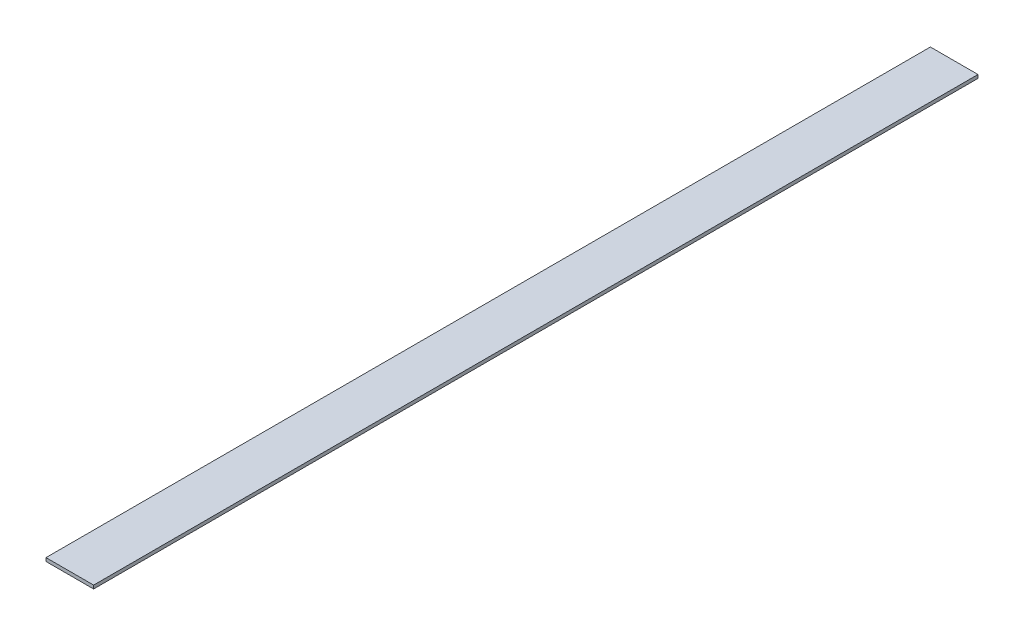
from build123d import *

# Parameters (mm, degrees)
ESQUISSE1_W          = 70
ESQUISSE1_H          = 5
BASE_EXTRUSION_DEPTH = 1300


with BuildPart() as part:
    # Esquisse1 → Base-Extrusion (new body)
    with BuildSketch(Plane.XY):
        with Locations((35, -2.5)):
            Rectangle(ESQUISSE1_W, ESQUISSE1_H)
    extrude(amount=-BASE_EXTRUSION_DEPTH)


solid = part.part
